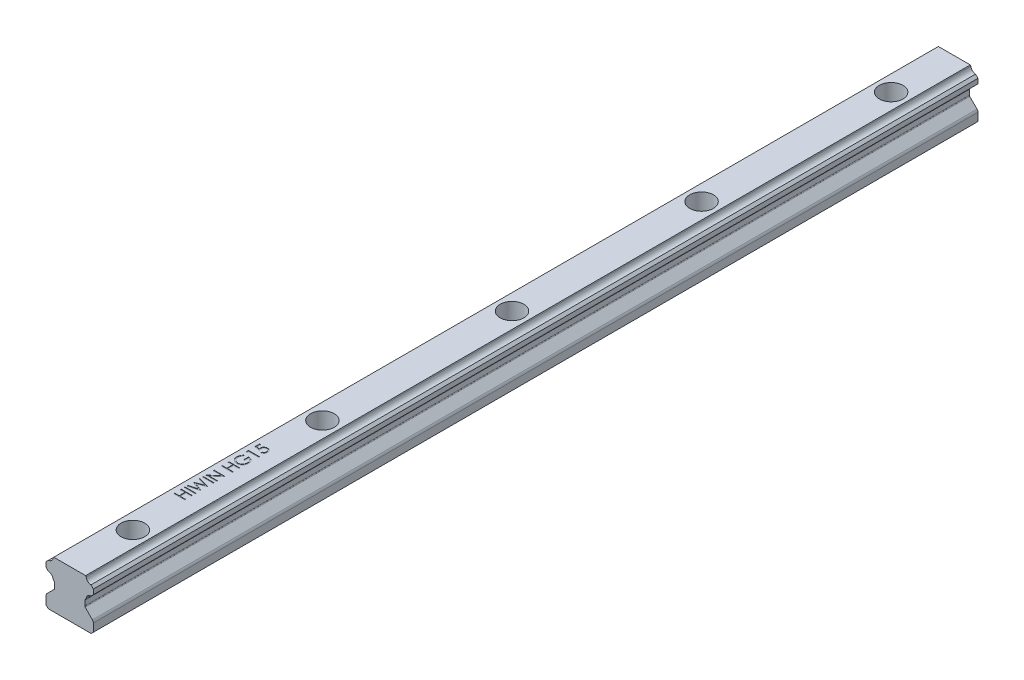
from build123d import *

# Parameters (mm, degrees)
EXTRUDE_1_DEPTH              = 280
HOLE_WIZARD_M4_1_D           = 4.5
HOLE_WIZARD_M4_1_CBORE_D     = 7.5
HOLE_WIZARD_M4_1_CBORE_DEPTH = 5.3
PATTERN_LINEAR_1_COUNT       = 5
PATTERN_LINEAR_1_PITCH       = 60
SKETCH_6_W                   = 3.5
SKETCH_6_H                   = 0.314102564
CUT_EXTRUDE_1_DEPTH          = 0.1


with BuildPart() as part:
    # Sketch 1 → Extrude 1 (new body)
    with BuildSketch(Plane.XY):
        with BuildLine():
            Line((7.5, 12.548994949), (6.730359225, 13.318635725))
            ThreePointArc((6.730359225, 13.318635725), (5.723905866, 13.746099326), (5.218323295, 14.715666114))
            ThreePointArc((5.218323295, 14.715666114), (5.180299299, 14.839173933), (5.104881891, 14.944113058))
            Line((5.104881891, 14.944113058), (5.04899495, 15))
            Line((5.04899495, 15), (-5.04899495, 15))
            Line((-5.04899495, 15), (-5.104881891, 14.944113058))
            ThreePointArc((-5.104881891, 14.944113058), (-5.180299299, 14.839173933), (-5.218323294, 14.715666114))
            ThreePointArc((-5.218323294, 14.715666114), (-5.723905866, 13.746099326), (-6.730359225, 13.318635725))
            Line((-6.730359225, 13.318635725), (-7.5, 12.548994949))
            Line((-7.5, 12.548994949), (-7.5, 11.011005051))
            Line((-7.5, 11.011005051), (-6.741857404, 10.252862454))
            ThreePointArc((-6.741857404, 10.252862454), (-5.724401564, 9.825237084), (-5.216972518, 8.845137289))
            ThreePointArc((-5.216972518, 8.845137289), (-5.179171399, 8.720266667), (-5.10319759, 8.614202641))
            Line((-5.10319759, 8.614202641), (-4.887157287, 8.398162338))
            ThreePointArc((-4.887157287, 8.398162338), (-4.800448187, 8.268392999), (-4.77, 8.115319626))
            Line((-4.77, 8.115319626), (-4.77, 6.553259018))
            ThreePointArc((-4.77, 6.553259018), (-4.800448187, 6.400185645), (-4.887157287, 6.270416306))
            Line((-4.887157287, 6.270416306), (-7.207106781, 3.950466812))
            ThreePointArc((-7.207106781, 3.950466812), (-7.423879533, 3.626043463), (-7.5, 3.243360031))
            Line((-7.5, 3.243360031), (-7.5, 0.7))
            Line((-7.5, 0.7), (-6.8, 0))
            Line((-6.8, 0), (6.8, 0))
            Line((6.8, 0), (7.5, 0.7))
            Line((7.5, 0.7), (7.5, 3.243360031))
            ThreePointArc((7.5, 3.243360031), (7.423879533, 3.626043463), (7.207106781, 3.950466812))
            Line((7.207106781, 3.950466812), (4.887157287, 6.270416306))
            ThreePointArc((4.887157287, 6.270416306), (4.800448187, 6.400185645), (4.77, 6.553259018))
            Line((4.77, 6.553259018), (4.77, 8.115319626))
            ThreePointArc((4.77, 8.115319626), (4.800448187, 8.268392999), (4.887157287, 8.398162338))
            Line((4.887157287, 8.398162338), (5.10319759, 8.614202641))
            ThreePointArc((5.10319759, 8.614202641), (5.179171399, 8.720266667), (5.216972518, 8.845137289))
            ThreePointArc((5.216972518, 8.845137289), (5.724401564, 9.825237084), (6.741857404, 10.252862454))
            Line((6.741857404, 10.252862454), (7.5, 11.011005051))
            Line((7.5, 11.011005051), (7.5, 12.548994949))
        make_face()
    extrude(amount=-EXTRUDE_1_DEPTH)

    # Hole Wizard M4 _1 (through all)
    with Locations(Plane(origin=(0.291487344, 15, -3.466272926), x_dir=(-1, 0, 0), z_dir=(0, 1, 0))):
        with Locations((0.291487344, -16.533727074)):
            hole_wizard_m4_1 = CounterBoreHole(HOLE_WIZARD_M4_1_D / 2, HOLE_WIZARD_M4_1_CBORE_D / 2, HOLE_WIZARD_M4_1_CBORE_DEPTH)

    # Pattern Linear 1: Hole Wizard M4 _1 ×5
    with Locations(*[(0, 0, -i * PATTERN_LINEAR_1_PITCH) for i in range(1, PATTERN_LINEAR_1_COUNT)]):
        add(hole_wizard_m4_1, mode=Mode.SUBTRACT)

    # Sketch 6 → Cut-Extrude 1 (cut)
    with BuildSketch(Plane(origin=(0, 15, 0), x_dir=(1, 0, 0), z_dir=(0, 1, 0))):
        Polygon((-3.5, 36.403846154), (-3.5, 36.717948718), (-2.064102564, 36.717948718), (-2.064102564, 38.512820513), (-3.5, 38.512820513), (-3.5, 38.826923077), (0, 38.826923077), (0, 38.512820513), (-1.705128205, 38.512820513), (-1.705128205, 36.717948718), (0, 36.717948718), (0, 36.403846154), align=None)
        with Locations((-1.75, 39.881410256)):
            Rectangle(SKETCH_6_W, SKETCH_6_H)
        Polygon((-3.5, 40.576923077), (-3.5, 40.901542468), (-0.933193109, 41.586538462), (-3.5, 42.605268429), (-3.5, 42.650841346), (-0.950721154, 43.650641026), (-3.5, 44.339142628), (-3.5, 44.66025641), (0, 43.716546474), (0, 43.671674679), (-2.676883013, 42.618589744), (0, 41.552884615), (0, 41.508012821), align=None)
        with Locations((-1.75, 45.625)):
            Rectangle(SKETCH_6_W, SKETCH_6_H)
        Polygon((0, 46.544871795), (-3.5, 46.544871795), (-3.5, 46.610777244), (-0.745292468, 48.923076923), (-3.5, 48.923076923), (-3.5, 49.237179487), (0, 49.237179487), (0, 49.165665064), (-2.748397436, 46.858974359), (0, 46.858974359), align=None)
        Polygon((-3.5, 51.480769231), (-3.5, 51.794871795), (-2.064102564, 51.794871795), (-2.064102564, 53.58974359), (-3.5, 53.58974359), (-3.5, 53.903846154), (0, 53.903846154), (0, 53.58974359), (-1.705128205, 53.58974359), (-1.705128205, 51.794871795), (0, 51.794871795), (0, 51.480769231), align=None)
        with BuildLine():
            Line((-2.902644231, 58.076923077), (-2.647435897, 57.807692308))
            add(Edge.make_bspline(
                [(-2.647435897, 57.807692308), (-2.69328212, 57.758983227), (-2.783881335, 57.662726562), (-2.901244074, 57.50552662), (-3.002777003, 57.342170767), (-3.084772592, 57.172394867), (-3.149094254, 57.000650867), (-3.195850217, 56.829891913), (-3.225460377, 56.661223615), (-3.229016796, 56.549059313), (-3.230769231, 56.493790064)],
                knots=[0, 0, 0, 0, 1.089067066, 2.152164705, 3.18986567, 4.218445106, 5.218487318, 6.173592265, 7.100032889, 8, 8, 8, 8], degree=3))
            add(Edge.make_bspline(
                [(-3.230769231, 56.493790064), (-3.230355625, 56.459875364), (-3.229529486, 56.392133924), (-3.218985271, 56.29151198), (-3.203820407, 56.191945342), (-3.181878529, 56.093621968), (-3.15406947, 55.99635068), (-3.119284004, 55.900469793), (-3.078728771, 55.805800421), (-3.031866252, 55.713234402), (-2.980386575, 55.623493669), (-2.923337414, 55.538737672), (-2.862550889, 55.458421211), (-2.796491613, 55.384072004), (-2.725807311, 55.31519549), (-2.651770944, 55.250524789), (-2.572926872, 55.191265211), (-2.489599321, 55.138479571), (-2.403726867, 55.090811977), (-2.316037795, 55.049619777), (-2.227346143, 55.013809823), (-2.136984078, 54.986535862), (-2.045883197, 54.963434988), (-1.953566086, 54.947353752), (-1.859791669, 54.938257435), (-1.796993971, 54.936686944), (-1.765424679, 54.935897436)],
                knots=[0, 0, 0, 0, 1.028150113, 2.053633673, 3.06513288, 4.081487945, 5.106702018, 6.131327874, 7.172780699, 8.228344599, 9.276313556, 10.308389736, 11.324843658, 12.329040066, 13.321460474, 14.316307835, 15.308626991, 16.309440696, 17.305625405, 18.28535951, 19.246194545, 20.203493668, 21.145557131, 22.095268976, 23.042464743, 24, 24, 24, 24], degree=3))
            add(Edge.make_bspline(
                [(-1.765424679, 54.935897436), (-1.733154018, 54.936653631), (-1.668700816, 54.938163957), (-1.572504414, 54.947817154), (-1.477747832, 54.965772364), (-1.384282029, 54.989584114), (-1.291920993, 55.019856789), (-1.20076111, 55.057049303), (-1.110811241, 55.101355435), (-1.022964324, 55.152526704), (-0.937464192, 55.209036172), (-0.856251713, 55.271187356), (-0.780271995, 55.339084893), (-0.708415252, 55.411483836), (-0.641134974, 55.489043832), (-0.579242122, 55.572517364), (-0.521779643, 55.660735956), (-0.469378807, 55.753738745), (-0.42257144, 55.850542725), (-0.38094723, 55.949799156), (-0.346667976, 56.051827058), (-0.31872985, 56.156089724), (-0.295829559, 56.262463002), (-0.281097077, 56.371486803), (-0.270406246, 56.482359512), (-0.269624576, 56.557098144), (-0.269230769, 56.594751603)],
                knots=[0, 0, 0, 0, 0.935915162, 1.869274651, 2.799799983, 3.730201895, 4.664668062, 5.616159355, 6.583070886, 7.570012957, 8.562524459, 9.553461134, 10.53281078, 11.515274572, 12.509912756, 13.507571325, 14.526460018, 15.561318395, 16.601025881, 17.643204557, 18.680545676, 19.719612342, 20.772381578, 21.833430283, 22.908478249, 24, 24, 24, 24], degree=3))
            add(Edge.make_bspline(
                [(-0.269230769, 56.594751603), (-0.270178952, 56.640130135), (-0.272040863, 56.729238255), (-0.286546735, 56.860222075), (-0.309173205, 56.986034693), (-0.342412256, 57.106266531), (-0.384484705, 57.221353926), (-0.436513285, 57.330872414), (-0.497950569, 57.435124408), (-0.567552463, 57.533658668), (-0.645100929, 57.624132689), (-0.728035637, 57.706474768), (-0.817431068, 57.77785339), (-0.911954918, 57.840400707), (-1.012511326, 57.892097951), (-1.118540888, 57.934543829), (-1.230109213, 57.967076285), (-1.307200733, 57.980431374), (-1.346153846, 57.987179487)],
                knots=[0, 0, 0, 0, 1.130199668, 2.219330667, 3.279027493, 4.311506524, 5.322739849, 6.327972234, 7.327472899, 8.33386792, 9.329086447, 10.29244429, 11.240784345, 12.174119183, 13.111530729, 14.052100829, 15.015757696, 16, 16, 16, 16], degree=3))
            Line((-1.346153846, 57.987179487), (-1.346153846, 56.820512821))
            Line((-1.346153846, 56.820512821), (-1.705128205, 56.820512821))
            Line((-1.705128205, 56.820512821), (-1.705128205, 58.301282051))
            add(Edge.make_bspline(
                [(-1.705128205, 58.301282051), (-1.638220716, 58.299576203), (-1.507270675, 58.296237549), (-1.316300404, 58.272818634), (-1.13592871, 58.235002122), (-0.965965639, 58.18334181), (-0.806652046, 58.116466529), (-0.65782618, 58.035094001), (-0.520449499, 57.93792188), (-0.393400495, 57.828411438), (-0.280071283, 57.705511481), (-0.180465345, 57.572542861), (-0.09656273, 57.429285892), (-0.028302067, 57.275876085), (0.024971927, 57.112815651), (0.062743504, 56.939727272), (0.085373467, 56.756845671), (0.088264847, 56.631508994), (0.08974359, 56.567407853)],
                knots=[0, 0, 0, 0, 1.140356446, 2.231883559, 3.274166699, 4.278491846, 5.25512956, 6.21435461, 7.1637429, 8.11826594, 9.068280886, 10.0076534, 10.945064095, 11.891975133, 12.864533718, 13.863980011, 14.907571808, 16, 16, 16, 16], degree=3))
            add(Edge.make_bspline(
                [(0.08974359, 56.567407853), (0.089174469, 56.527897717), (0.088051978, 56.449970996), (0.080074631, 56.334880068), (0.067794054, 56.222962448), (0.049248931, 56.114234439), (0.026534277, 56.008296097), (-0.002552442, 55.905676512), (-0.036221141, 55.80598477), (-0.074516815, 55.709066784), (-0.118888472, 55.615802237), (-0.168198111, 55.52577572), (-0.222191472, 55.438489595), (-0.281802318, 55.35453843), (-0.346584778, 55.273484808), (-0.416668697, 55.195851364), (-0.491839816, 55.121203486), (-0.545218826, 55.074443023), (-0.572115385, 55.05088141)],
                knots=[0, 0, 0, 0, 1.107784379, 2.184907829, 3.233506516, 4.263428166, 5.276301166, 6.270063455, 7.25232949, 8.225834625, 9.190232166, 10.146266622, 11.1027726, 12.066435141, 13.031522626, 14.010570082, 14.99756817, 16, 16, 16, 16], degree=3))
            add(Edge.make_bspline(
                [(-0.572115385, 55.05088141), (-0.614786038, 55.016695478), (-0.699419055, 54.948891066), (-0.835018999, 54.861612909), (-0.975420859, 54.787211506), (-1.121015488, 54.726843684), (-1.271666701, 54.679705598), (-1.427181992, 54.645899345), (-1.587761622, 54.626092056), (-1.696426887, 54.623238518), (-1.751402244, 54.621794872)],
                knots=[0, 0, 0, 0, 1.023165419, 2.029347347, 3.013907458, 3.994755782, 4.975994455, 5.96558838, 6.970761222, 8, 8, 8, 8], degree=3))
            add(Edge.make_bspline(
                [(-1.751402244, 54.621794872), (-1.792568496, 54.62232711), (-1.874377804, 54.623384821), (-1.99583511, 54.636210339), (-2.115135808, 54.654611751), (-2.232182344, 54.681658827), (-2.347053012, 54.715755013), (-2.45980069, 54.758308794), (-2.570493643, 54.807852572), (-2.67836343, 54.865442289), (-2.782003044, 54.929511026), (-2.880905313, 54.999118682), (-2.973467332, 55.074802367), (-3.059903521, 55.156782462), (-3.141494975, 55.243406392), (-3.216537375, 55.336492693), (-3.286205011, 55.434631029), (-3.349159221, 55.538582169), (-3.405727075, 55.6467058), (-3.455315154, 55.758766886), (-3.496298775, 55.874724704), (-3.531072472, 55.993712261), (-3.556787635, 56.11662974), (-3.575436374, 56.242585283), (-3.588196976, 56.372235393), (-3.589223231, 56.459871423), (-3.58974359, 56.504306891)],
                knots=[0, 0, 0, 0, 1.00895651, 2.005089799, 2.991467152, 3.967318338, 4.948153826, 5.927364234, 6.919980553, 7.91976625, 8.923240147, 9.905815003, 10.88314567, 11.851989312, 12.825009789, 13.798721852, 14.781296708, 15.773896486, 16.776076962, 17.771600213, 18.775744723, 19.78957137, 20.808953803, 21.851964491, 22.910847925, 24, 24, 24, 24], degree=3))
            add(Edge.make_bspline(
                [(-3.58974359, 56.504306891), (-3.589164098, 56.540545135), (-3.588015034, 56.612401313), (-3.580050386, 56.719327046), (-3.567426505, 56.82460006), (-3.550199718, 56.92837645), (-3.526736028, 57.030302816), (-3.498657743, 57.130669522), (-3.46596592, 57.229622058), (-3.426977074, 57.326850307), (-3.382723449, 57.423008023), (-3.332910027, 57.518629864), (-3.276685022, 57.61338911), (-3.213881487, 57.707450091), (-3.145578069, 57.801405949), (-3.069821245, 57.893770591), (-2.989598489, 57.986773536), (-2.931916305, 58.04657535), (-2.902644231, 58.076923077)],
                knots=[0, 0, 0, 0, 0.985871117, 1.954866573, 2.915460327, 3.869826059, 4.81536089, 5.759505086, 6.70452669, 7.649098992, 8.607881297, 9.583363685, 10.581137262, 11.603961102, 12.659522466, 13.73993555, 14.853081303, 16, 16, 16, 16], degree=3))
        make_face()
        Polygon((-3.5, 59.449018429), (-3.5, 60.096153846), (0, 60.096153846), (0, 59.782051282), (-3.141025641, 59.782051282), (-3.141025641, 59.243589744), align=None)
        with BuildLine():
            Line((-3.5, 63.596153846), (-3.141025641, 63.596153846))
            Line((-3.141025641, 63.596153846), (-3.141025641, 62.405649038))
            Line((-3.141025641, 62.405649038), (-2.220452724, 62.217047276))
            add(Edge.make_bspline(
                [(-2.220452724, 62.217047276), (-2.230682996, 62.25410315), (-2.25050253, 62.325893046), (-2.2725083, 62.431852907), (-2.285773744, 62.53244511), (-2.287585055, 62.597720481), (-2.288461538, 62.629306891)],
                knots=[0, 0, 0, 0, 1.100273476, 2.13160584, 3.095893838, 4, 4, 4, 4], degree=3))
            add(Edge.make_bspline(
                [(-2.288461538, 62.629306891), (-2.28764354, 62.668397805), (-2.28603515, 62.745260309), (-2.269673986, 62.857544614), (-2.245976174, 62.96527195), (-2.209465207, 63.066851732), (-2.164878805, 63.163891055), (-2.108721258, 63.254723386), (-2.04315746, 63.34062356), (-1.968525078, 63.420997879), (-1.885534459, 63.493570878), (-1.795933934, 63.556634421), (-1.701678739, 63.611677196), (-1.600559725, 63.654605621), (-1.494484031, 63.689639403), (-1.382227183, 63.712740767), (-1.264785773, 63.728171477), (-1.18448027, 63.729891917), (-1.143529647, 63.730769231)],
                knots=[0, 0, 0, 0, 1.052805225, 2.070078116, 3.052532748, 4.020689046, 4.973125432, 5.925915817, 6.89216474, 7.881560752, 8.877013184, 9.857446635, 10.830895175, 11.812622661, 12.812548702, 13.836681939, 14.896847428, 16, 16, 16, 16], degree=3))
            add(Edge.make_bspline(
                [(-1.143529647, 63.730769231), (-1.115007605, 63.730103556), (-1.058348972, 63.728781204), (-0.974202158, 63.7220714), (-0.891849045, 63.709103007), (-0.811440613, 63.69190289), (-0.732901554, 63.668941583), (-0.65579213, 63.642084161), (-0.580956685, 63.608702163), (-0.508064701, 63.571694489), (-0.437950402, 63.530715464), (-0.372294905, 63.484635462), (-0.309599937, 63.436755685), (-0.251727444, 63.384438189), (-0.198452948, 63.328277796), (-0.149513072, 63.268586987), (-0.104029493, 63.205907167), (-0.063861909, 63.139251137), (-0.026898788, 63.070108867), (0.003424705, 62.997480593), (0.030535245, 62.923019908), (0.05214477, 62.845655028), (0.069077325, 62.765561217), (0.080577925, 62.682606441), (0.088954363, 62.597225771), (0.08947872, 62.539350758), (0.08974359, 62.510116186)],
                knots=[0, 0, 0, 0, 1.056393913, 2.098511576, 3.122979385, 4.141471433, 5.141222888, 6.151259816, 7.162667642, 8.172852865, 9.177685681, 10.166741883, 11.141342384, 12.097242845, 13.052202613, 14.005160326, 14.953864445, 15.917140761, 16.884916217, 17.854238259, 18.828761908, 19.81781811, 20.826036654, 21.857789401, 22.917898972, 24, 24, 24, 24], degree=3))
            add(Edge.make_bspline(
                [(0.08974359, 62.510116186), (0.089050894, 62.475242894), (0.087688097, 62.406633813), (0.073496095, 62.30610057), (0.053035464, 62.209432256), (0.022721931, 62.117043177), (-0.016971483, 62.029318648), (-0.064133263, 61.945002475), (-0.12027864, 61.865139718), (-0.184894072, 61.790276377), (-0.255892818, 61.721460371), (-0.332202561, 61.65905751), (-0.413920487, 61.604193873), (-0.500780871, 61.556670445), (-0.592629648, 61.516184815), (-0.689749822, 61.484366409), (-0.791650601, 61.45868899), (-0.861804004, 61.447825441), (-0.897435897, 61.442307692)],
                knots=[0, 0, 0, 0, 1.046872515, 2.059598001, 3.044168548, 4.012104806, 4.973680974, 5.932408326, 6.910122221, 7.900780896, 8.89867654, 9.876692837, 10.858029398, 11.85084981, 12.847361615, 13.868568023, 14.917415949, 16, 16, 16, 16], degree=3))
            Line((-0.897435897, 61.442307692), (-0.897435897, 61.756410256))
            add(Edge.make_bspline(
                [(-0.897435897, 61.756410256), (-0.86405597, 61.764133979), (-0.799897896, 61.778979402), (-0.709812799, 61.811649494), (-0.62950762, 61.851206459), (-0.558491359, 61.899340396), (-0.495464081, 61.955133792), (-0.43989307, 62.019990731), (-0.389697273, 62.092289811), (-0.347784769, 62.17267219), (-0.312479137, 62.257640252), (-0.287283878, 62.346063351), (-0.272032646, 62.436668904), (-0.270168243, 62.497671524), (-0.269230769, 62.528345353)],
                knots=[0, 0, 0, 0, 1.13623081, 2.183898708, 3.172478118, 4.09966615, 5.022692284, 5.957376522, 6.927682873, 7.937366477, 8.960015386, 9.976409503, 10.982481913, 12, 12, 12, 12], degree=3))
            add(Edge.make_bspline(
                [(-0.269230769, 62.528345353), (-0.270058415, 62.558301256), (-0.271688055, 62.617284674), (-0.284028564, 62.704132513), (-0.303533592, 62.787735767), (-0.33085902, 62.868242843), (-0.367008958, 62.945258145), (-0.411417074, 63.018672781), (-0.462975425, 63.089532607), (-0.521904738, 63.1559727), (-0.586881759, 63.216808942), (-0.656357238, 63.270565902), (-0.730474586, 63.315342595), (-0.807947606, 63.353076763), (-0.889626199, 63.381730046), (-0.975127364, 63.402171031), (-1.064662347, 63.414174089), (-1.125731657, 63.415825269), (-1.156850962, 63.416666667)],
                knots=[0, 0, 0, 0, 1.027268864, 2.022700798, 3.002744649, 3.968653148, 4.933396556, 5.915045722, 6.907600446, 7.935526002, 8.956456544, 9.95700807, 10.942805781, 11.92166854, 12.907987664, 13.905483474, 14.932689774, 16, 16, 16, 16], degree=3))
            add(Edge.make_bspline(
                [(-1.156850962, 63.416666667), (-1.184930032, 63.416028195), (-1.239659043, 63.414783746), (-1.320009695, 63.404010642), (-1.396158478, 63.386014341), (-1.468436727, 63.360391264), (-1.536613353, 63.328412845), (-1.600538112, 63.288262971), (-1.660812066, 63.241651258), (-1.715884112, 63.187233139), (-1.766793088, 63.12803749), (-1.810034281, 63.062543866), (-1.846807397, 62.992500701), (-1.876936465, 62.917778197), (-1.900936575, 62.838284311), (-1.917523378, 62.753976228), (-1.92744867, 62.664834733), (-1.928795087, 62.603859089), (-1.929487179, 62.572516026)],
                knots=[0, 0, 0, 0, 1.045723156, 2.038222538, 3.013889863, 3.95567481, 4.890389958, 5.81331128, 6.76251276, 7.723027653, 8.692928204, 9.666105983, 10.639751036, 11.635719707, 12.66315958, 13.728667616, 14.832476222, 16, 16, 16, 16], degree=3))
            add(Edge.make_bspline(
                [(-1.929487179, 62.572516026), (-1.928906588, 62.545387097), (-1.927707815, 62.489372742), (-1.918881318, 62.403449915), (-1.904642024, 62.313158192), (-1.885055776, 62.218843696), (-1.859424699, 62.120223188), (-1.828710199, 62.017504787), (-1.7919882, 61.910472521), (-1.764255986, 61.838354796), (-1.75, 61.801282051)],
                knots=[0, 0, 0, 0, 0.817624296, 1.688186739, 2.600797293, 3.572016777, 4.590301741, 5.671205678, 6.80286297, 8, 8, 8, 8], degree=3))
            Line((-1.75, 61.801282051), (-3.5, 62.16025641))
            Line((-3.5, 62.16025641), (-3.5, 63.596153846))
        make_face()
    extrude(amount=-CUT_EXTRUDE_1_DEPTH, mode=Mode.SUBTRACT)


solid = part.part
